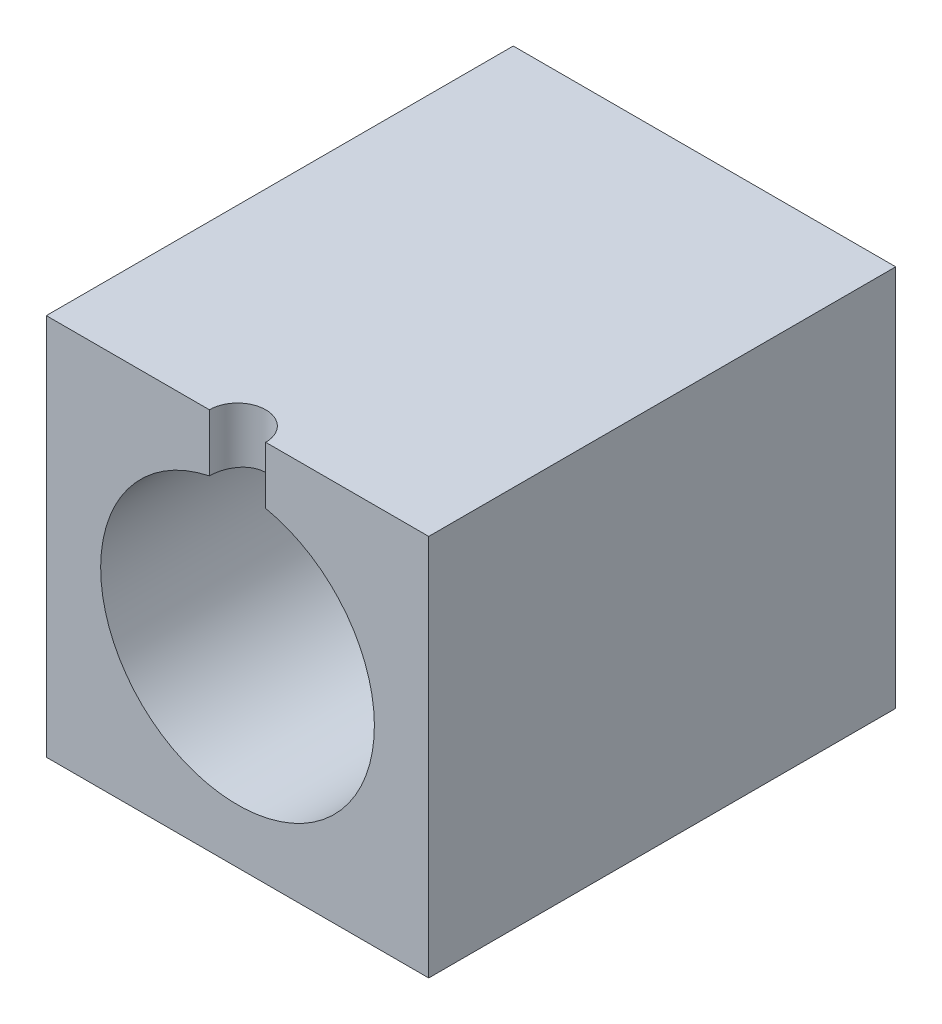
ISO-10303-21;
HEADER;
FILE_DESCRIPTION(('STEP AP214'),'2;1');
FILE_NAME('part.step','',(''),(''),'','','');
FILE_SCHEMA(('AUTOMOTIVE_DESIGN { 1 0 10303 214 1 1 1 1 }'));
ENDSEC;
DATA;
#1=APPLICATION_CONTEXT('core data for automotive mechanical design processes');
#2=APPLICATION_PROTOCOL_DEFINITION('international standard','automotive_design',2000,#1);
#3=PRODUCT_CONTEXT('',#1,'mechanical');
#4=PRODUCT('Part','Part','',(#3));
#5=PRODUCT_RELATED_PRODUCT_CATEGORY('part','',(#4));
#6=PRODUCT_DEFINITION_FORMATION('','',#4);
#7=PRODUCT_DEFINITION_CONTEXT('part definition',#1,'design');
#8=PRODUCT_DEFINITION('design','',#6,#7);
#9=PRODUCT_DEFINITION_SHAPE('','',#8);
#10=(LENGTH_UNIT() NAMED_UNIT(*) SI_UNIT(.MILLI.,.METRE.));
#11=(NAMED_UNIT(*) PLANE_ANGLE_UNIT() SI_UNIT($,.RADIAN.));
#12=(NAMED_UNIT(*) SI_UNIT($,.STERADIAN.) SOLID_ANGLE_UNIT());
#13=UNCERTAINTY_MEASURE_WITH_UNIT(LENGTH_MEASURE(1.E-05),#10,'distance_accuracy_value','');
#14=(GEOMETRIC_REPRESENTATION_CONTEXT(3) GLOBAL_UNCERTAINTY_ASSIGNED_CONTEXT((#13)) GLOBAL_UNIT_ASSIGNED_CONTEXT((#10,
#11,#12)) REPRESENTATION_CONTEXT('',''));
#15=CARTESIAN_POINT('',(0.,0.,0.));
#16=DIRECTION('',(0.,0.,1.));
#17=DIRECTION('',(1.,0.,0.));
#18=AXIS2_PLACEMENT_3D('',#15,#16,#17);
#19=CARTESIAN_POINT('',(0.,0.,58.));
#20=DIRECTION('',(0.,0.,1.));
#21=DIRECTION('',(1.,0.,0.));
#22=AXIS2_PLACEMENT_3D('',#19,#20,#21);
#23=PLANE('',#22);
#24=CARTESIAN_POINT('',(-14.1949152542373,-7.78601694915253,58.));
#25=DIRECTION('',(0.,0.,1.));
#26=DIRECTION('',(1.,0.,0.));
#27=AXIS2_PLACEMENT_3D('',#24,#25,#26);
#28=CIRCLE('',#27,17.);
#29=CARTESIAN_POINT('',(-17.6949152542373,8.8497878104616,58.));
#30=VERTEX_POINT('',#29);
#31=CARTESIAN_POINT('',(-10.6949152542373,8.8497878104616,58.));
#32=VERTEX_POINT('',#31);
#33=EDGE_CURVE('E96',#30,#32,#28,.T.);
#34=ORIENTED_EDGE('',*,*,#33,.F.);
#35=DIRECTION('',(0.,-1.,0.));
#36=VECTOR('',#35,1.);
#37=CARTESIAN_POINT('',(-17.6949152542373,20.9639830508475,58.));
#38=LINE('',#37,#36);
#39=CARTESIAN_POINT('',(-17.6949152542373,15.9639830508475,58.));
#40=VERTEX_POINT('',#39);
#41=EDGE_CURVE('E52',#30,#40,#38,.F.);
#42=ORIENTED_EDGE('',*,*,#41,.T.);
#43=DIRECTION('',(-1.,0.,0.));
#44=VECTOR('',#43,1.);
#45=CARTESIAN_POINT('',(-37.9449152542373,15.9639830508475,58.));
#46=LINE('',#45,#44);
#47=CARTESIAN_POINT('',(-37.9449152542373,15.9639830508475,58.));
#48=VERTEX_POINT('',#47);
#49=EDGE_CURVE('E105',#40,#48,#46,.T.);
#50=ORIENTED_EDGE('',*,*,#49,.T.);
#51=DIRECTION('',(0.,-1.,0.));
#52=VECTOR('',#51,1.);
#53=CARTESIAN_POINT('',(-37.9449152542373,15.9639830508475,58.));
#54=LINE('',#53,#52);
#55=CARTESIAN_POINT('',(-37.9449152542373,-31.5360169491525,58.));
#56=VERTEX_POINT('',#55);
#57=EDGE_CURVE('E114',#48,#56,#54,.T.);
#58=ORIENTED_EDGE('',*,*,#57,.T.);
#59=DIRECTION('',(1.,0.,0.));
#60=VECTOR('',#59,1.);
#61=CARTESIAN_POINT('',(-37.9449152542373,-31.5360169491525,58.));
#62=LINE('',#61,#60);
#63=CARTESIAN_POINT('',(9.55508474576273,-31.5360169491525,58.));
#64=VERTEX_POINT('',#63);
#65=EDGE_CURVE('E117',#56,#64,#62,.T.);
#66=ORIENTED_EDGE('',*,*,#65,.T.);
#67=DIRECTION('',(0.,1.,0.));
#68=VECTOR('',#67,1.);
#69=CARTESIAN_POINT('',(9.55508474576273,15.9639830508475,58.));
#70=LINE('',#69,#68);
#71=CARTESIAN_POINT('',(9.55508474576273,15.9639830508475,58.));
#72=VERTEX_POINT('',#71);
#73=EDGE_CURVE('E102',#64,#72,#70,.T.);
#74=ORIENTED_EDGE('',*,*,#73,.T.);
#75=CARTESIAN_POINT('',(-10.6949152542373,15.9639830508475,58.));
#76=VERTEX_POINT('',#75);
#77=EDGE_CURVE('E99',#72,#76,#46,.T.);
#78=ORIENTED_EDGE('',*,*,#77,.T.);
#79=DIRECTION('',(0.,-1.,0.));
#80=VECTOR('',#79,1.);
#81=CARTESIAN_POINT('',(-10.6949152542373,20.9639830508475,58.));
#82=LINE('',#81,#80);
#83=EDGE_CURVE('E89',#76,#32,#82,.T.);
#84=ORIENTED_EDGE('',*,*,#83,.T.);
#85=EDGE_LOOP('',(#34,#42,#50,#58,#66,#74,#78,#84));
#86=FACE_BOUND('',#85,.T.);
#87=ADVANCED_FACE('F32',(#86),#23,.T.);
#88=CARTESIAN_POINT('',(-14.1949152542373,-7.78601694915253,58.));
#89=DIRECTION('',(0.,0.,-1.));
#90=DIRECTION('',(-1.,0.,0.));
#91=AXIS2_PLACEMENT_3D('',#88,#89,#90);
#92=CYLINDRICAL_SURFACE('',#91,17.);
#93=CARTESIAN_POINT('',(-14.1949152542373,-7.78601694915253,19.));
#94=DIRECTION('',(0.,0.,1.));
#95=DIRECTION('',(1.,0.,0.));
#96=AXIS2_PLACEMENT_3D('',#93,#94,#95);
#97=CIRCLE('',#96,17.);
#98=CARTESIAN_POINT('',(2.80508474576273,-7.78601694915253,19.));
#99=VERTEX_POINT('',#98);
#100=EDGE_CURVE('E103',#99,#99,#97,.T.);
#101=ORIENTED_EDGE('',*,*,#100,.F.);
#102=EDGE_LOOP('',(#101));
#103=FACE_BOUND('',#102,.T.);
#104=ORIENTED_EDGE('',*,*,#33,.T.);
#105=CARTESIAN_POINT('',(-10.6949152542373,8.8497878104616,58.));
#106=CARTESIAN_POINT('',(-10.6949046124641,8.84977910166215,57.9026735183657));
#107=CARTESIAN_POINT('',(-10.6989747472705,8.85064172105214,57.8053529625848));
#108=CARTESIAN_POINT('',(-10.7151940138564,8.85404512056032,57.61142907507));
#109=CARTESIAN_POINT('',(-10.7273421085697,8.8565856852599,57.5148256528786));
#110=CARTESIAN_POINT('',(-10.7596094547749,8.86327526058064,57.3231664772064));
#111=CARTESIAN_POINT('',(-10.7797161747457,8.86742174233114,57.2281085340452));
#112=CARTESIAN_POINT('',(-10.8277217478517,8.87719411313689,57.0400858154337));
#113=CARTESIAN_POINT('',(-10.8556206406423,8.88282000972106,56.9471210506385));
#114=CARTESIAN_POINT('',(-10.9507254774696,8.90168725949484,56.6723256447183));
#115=CARTESIAN_POINT('',(-11.0293660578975,8.91692401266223,56.4944378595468));
#116=CARTESIAN_POINT('',(-11.2147303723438,8.95098755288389,56.1544499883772));
#117=CARTESIAN_POINT('',(-11.3214575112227,8.96981477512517,55.9923518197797));
#118=CARTESIAN_POINT('',(-11.5616798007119,9.00925163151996,55.6860355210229));
#119=CARTESIAN_POINT('',(-11.6955124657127,9.02988166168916,55.5420842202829));
#120=CARTESIAN_POINT('',(-11.9854235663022,9.0704219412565,55.2785033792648));
#121=CARTESIAN_POINT('',(-12.1415054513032,9.09033207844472,55.1588776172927));
#122=CARTESIAN_POINT('',(-12.4732684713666,9.12740983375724,54.9462983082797));
#123=CARTESIAN_POINT('',(-12.6491174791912,9.14455039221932,54.8536016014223));
#124=CARTESIAN_POINT('',(-13.0142972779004,9.17392554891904,54.6991775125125));
#125=CARTESIAN_POINT('',(-13.2036260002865,9.18616089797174,54.6374453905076));
#126=CARTESIAN_POINT('',(-13.5876021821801,9.2042032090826,54.5475360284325));
#127=CARTESIAN_POINT('',(-13.7821388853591,9.2100973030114,54.5189035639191));
#128=CARTESIAN_POINT('',(-14.173342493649,9.2150942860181,54.4945850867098));
#129=CARTESIAN_POINT('',(-14.3700092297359,9.2141977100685,54.49889647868));
#130=CARTESIAN_POINT('',(-14.7567494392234,9.20578134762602,54.5400012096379));
#131=CARTESIAN_POINT('',(-14.9468776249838,9.19836173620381,54.5763032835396));
#132=CARTESIAN_POINT('',(-15.3182830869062,9.1778463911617,54.6795780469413));
#133=CARTESIAN_POINT('',(-15.4995600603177,9.16475046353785,54.7465517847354));
#134=CARTESIAN_POINT('',(-15.84951163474,9.13418983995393,54.9097195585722));
#135=CARTESIAN_POINT('',(-16.0180945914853,9.1166967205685,55.0061046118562));
#136=CARTESIAN_POINT('',(-16.336869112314,9.07926782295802,55.2252110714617));
#137=CARTESIAN_POINT('',(-16.487059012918,9.05933182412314,55.3479348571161));
#138=CARTESIAN_POINT('',(-16.7676922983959,9.01878366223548,55.6189192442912));
#139=CARTESIAN_POINT('',(-16.8977228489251,8.99816580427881,55.7676070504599));
#140=CARTESIAN_POINT('',(-17.1311026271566,8.95891802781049,56.0848954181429));
#141=CARTESIAN_POINT('',(-17.2344444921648,8.94028865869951,56.2535014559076));
#142=CARTESIAN_POINT('',(-17.4117017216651,8.90711062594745,56.6066715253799));
#143=CARTESIAN_POINT('',(-17.4855300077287,8.89257407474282,56.7912808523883));
#144=CARTESIAN_POINT('',(-17.5720595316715,8.87518712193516,57.075477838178));
#145=CARTESIAN_POINT('',(-17.5968651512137,8.87012824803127,57.171407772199));
#146=CARTESIAN_POINT('',(-17.6382656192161,8.86161938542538,57.3650812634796));
#147=CARTESIAN_POINT('',(-17.6548643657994,8.8581686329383,57.4628239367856));
#148=CARTESIAN_POINT('',(-17.6764915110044,8.85365596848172,57.6339148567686));
#149=CARTESIAN_POINT('',(-17.6834034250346,8.85220677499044,57.7070223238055));
#150=CARTESIAN_POINT('',(-17.6926124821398,8.8502723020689,57.8534170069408));
#151=CARTESIAN_POINT('',(-17.6949173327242,8.84978541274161,57.9267037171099));
#152=CARTESIAN_POINT('',(-17.6949152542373,8.8497878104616,58.));
#153=B_SPLINE_CURVE_WITH_KNOTS('',3,(#105,#106,#107,#108,#109,#110,#111,#112,#113,#114,#115,
#116,#117,#118,#119,#120,#121,#122,#123,#124,#125,#126,#127,#128,#129,#130,#131,#132,#133,#134,
#135,#136,#137,#138,#139,#140,#141,#142,#143,#144,#145,#146,#147,#148,#149,#150,#151,#152),
.UNSPECIFIED.,.F.,.F.,(4,2,2,2,2,2,2,2,2,2,2,2,2,2,2,2,2,2,2,2,2,2,2,4),(0.,0.291880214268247,
0.583722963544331,0.875107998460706,1.16649451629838,1.74879841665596,2.33117294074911,
2.92130226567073,3.51152318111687,4.10720132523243,4.70278825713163,5.29008270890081,
5.87733089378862,6.45571514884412,7.03411917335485,7.61636272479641,8.19865889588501,
8.79163820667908,9.38478093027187,9.9796610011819,10.2770041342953,10.5742058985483,
10.7944068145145,11.0142390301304),.UNSPECIFIED.);
#154=EDGE_CURVE('E11',#32,#30,#153,.T.);
#155=ORIENTED_EDGE('',*,*,#154,.T.);
#156=EDGE_LOOP('',(#104,#155));
#157=FACE_BOUND('',#156,.T.);
#158=ADVANCED_FACE('F101',(#103,#157),#92,.F.);
#159=CARTESIAN_POINT('',(0.,0.,0.));
#160=DIRECTION('',(0.,0.,1.));
#161=DIRECTION('',(1.,0.,0.));
#162=AXIS2_PLACEMENT_3D('',#159,#160,#161);
#163=PLANE('',#162);
#164=DIRECTION('',(0.,1.,0.));
#165=VECTOR('',#164,1.);
#166=CARTESIAN_POINT('',(9.55508474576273,15.9639830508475,0.));
#167=LINE('',#166,#165);
#168=CARTESIAN_POINT('',(9.55508474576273,-31.5360169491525,0.));
#169=VERTEX_POINT('',#168);
#170=CARTESIAN_POINT('',(9.55508474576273,15.9639830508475,0.));
#171=VERTEX_POINT('',#170);
#172=EDGE_CURVE('E126',#169,#171,#167,.T.);
#173=ORIENTED_EDGE('',*,*,#172,.F.);
#174=DIRECTION('',(1.,0.,0.));
#175=VECTOR('',#174,1.);
#176=CARTESIAN_POINT('',(-37.9449152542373,-31.5360169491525,0.));
#177=LINE('',#176,#175);
#178=CARTESIAN_POINT('',(-37.9449152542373,-31.5360169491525,0.));
#179=VERTEX_POINT('',#178);
#180=EDGE_CURVE('E59',#179,#169,#177,.T.);
#181=ORIENTED_EDGE('',*,*,#180,.F.);
#182=DIRECTION('',(0.,-1.,0.));
#183=VECTOR('',#182,1.);
#184=CARTESIAN_POINT('',(-37.9449152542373,15.9639830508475,0.));
#185=LINE('',#184,#183);
#186=CARTESIAN_POINT('',(-37.9449152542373,15.9639830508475,0.));
#187=VERTEX_POINT('',#186);
#188=EDGE_CURVE('E131',#187,#179,#185,.T.);
#189=ORIENTED_EDGE('',*,*,#188,.F.);
#190=DIRECTION('',(-1.,0.,0.));
#191=VECTOR('',#190,1.);
#192=CARTESIAN_POINT('',(-37.9449152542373,15.9639830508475,0.));
#193=LINE('',#192,#191);
#194=EDGE_CURVE('E129',#171,#187,#193,.T.);
#195=ORIENTED_EDGE('',*,*,#194,.F.);
#196=EDGE_LOOP('',(#173,#181,#189,#195));
#197=FACE_BOUND('',#196,.T.);
#198=CARTESIAN_POINT('',(-14.1949152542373,-7.78601694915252,0.));
#199=DIRECTION('',(0.,0.,1.));
#200=DIRECTION('',(1.,0.,0.));
#201=AXIS2_PLACEMENT_3D('',#198,#199,#200);
#202=CIRCLE('',#201,18.6728986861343);
#203=CARTESIAN_POINT('',(4.47798343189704,-7.78601694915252,0.));
#204=VERTEX_POINT('',#203);
#205=EDGE_CURVE('E123',#204,#204,#202,.T.);
#206=ORIENTED_EDGE('',*,*,#205,.T.);
#207=EDGE_LOOP('',(#206));
#208=FACE_BOUND('',#207,.T.);
#209=ADVANCED_FACE('F148',(#197,#208),#163,.F.);
#210=CARTESIAN_POINT('',(9.55508474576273,15.9639830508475,19.));
#211=DIRECTION('',(-1.,0.,0.));
#212=DIRECTION('',(0.,0.,1.));
#213=AXIS2_PLACEMENT_3D('',#210,#211,#212);
#214=PLANE('',#213);
#215=ORIENTED_EDGE('',*,*,#172,.T.);
#216=DIRECTION('',(0.,0.,-1.));
#217=VECTOR('',#216,1.);
#218=CARTESIAN_POINT('',(9.55508474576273,15.9639830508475,19.));
#219=LINE('',#218,#217);
#220=EDGE_CURVE('E45',#72,#171,#219,.T.);
#221=ORIENTED_EDGE('',*,*,#220,.F.);
#222=ORIENTED_EDGE('',*,*,#73,.F.);
#223=DIRECTION('',(0.,0.,-1.));
#224=VECTOR('',#223,1.);
#225=CARTESIAN_POINT('',(9.55508474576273,-31.5360169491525,19.));
#226=LINE('',#225,#224);
#227=EDGE_CURVE('E134',#64,#169,#226,.T.);
#228=ORIENTED_EDGE('',*,*,#227,.T.);
#229=EDGE_LOOP('',(#215,#221,#222,#228));
#230=FACE_BOUND('',#229,.T.);
#231=ADVANCED_FACE('F34',(#230),#214,.F.);
#232=CARTESIAN_POINT('',(-37.9449152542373,15.9639830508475,19.));
#233=DIRECTION('',(0.,-1.,0.));
#234=DIRECTION('',(1.,0.,0.));
#235=AXIS2_PLACEMENT_3D('',#232,#233,#234);
#236=PLANE('',#235);
#237=CARTESIAN_POINT('',(-14.1949152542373,15.9639830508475,58.));
#238=DIRECTION('',(0.,-1.,0.));
#239=DIRECTION('',(1.,0.,0.));
#240=AXIS2_PLACEMENT_3D('',#237,#238,#239);
#241=CIRCLE('',#240,3.5);
#242=EDGE_CURVE('E108',#76,#40,#241,.F.);
#243=ORIENTED_EDGE('',*,*,#242,.F.);
#244=ORIENTED_EDGE('',*,*,#77,.F.);
#245=ORIENTED_EDGE('',*,*,#220,.T.);
#246=ORIENTED_EDGE('',*,*,#194,.T.);
#247=DIRECTION('',(0.,0.,-1.));
#248=VECTOR('',#247,1.);
#249=CARTESIAN_POINT('',(-37.9449152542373,15.9639830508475,19.));
#250=LINE('',#249,#248);
#251=EDGE_CURVE('E138',#48,#187,#250,.T.);
#252=ORIENTED_EDGE('',*,*,#251,.F.);
#253=ORIENTED_EDGE('',*,*,#49,.F.);
#254=EDGE_LOOP('',(#243,#244,#245,#246,#252,#253));
#255=FACE_BOUND('',#254,.T.);
#256=ADVANCED_FACE('F142',(#255),#236,.F.);
#257=CARTESIAN_POINT('',(-37.9449152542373,15.9639830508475,19.));
#258=DIRECTION('',(1.,0.,0.));
#259=DIRECTION('',(0.,0.,-1.));
#260=AXIS2_PLACEMENT_3D('',#257,#258,#259);
#261=PLANE('',#260);
#262=ORIENTED_EDGE('',*,*,#188,.T.);
#263=DIRECTION('',(0.,0.,-1.));
#264=VECTOR('',#263,1.);
#265=CARTESIAN_POINT('',(-37.9449152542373,-31.5360169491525,19.));
#266=LINE('',#265,#264);
#267=EDGE_CURVE('E136',#56,#179,#266,.T.);
#268=ORIENTED_EDGE('',*,*,#267,.F.);
#269=ORIENTED_EDGE('',*,*,#57,.F.);
#270=ORIENTED_EDGE('',*,*,#251,.T.);
#271=EDGE_LOOP('',(#262,#268,#269,#270));
#272=FACE_BOUND('',#271,.T.);
#273=ADVANCED_FACE('F152',(#272),#261,.F.);
#274=CARTESIAN_POINT('',(-37.9449152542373,-31.5360169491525,19.));
#275=DIRECTION('',(0.,1.,0.));
#276=DIRECTION('',(0.,0.,1.));
#277=AXIS2_PLACEMENT_3D('',#274,#275,#276);
#278=PLANE('',#277);
#279=ORIENTED_EDGE('',*,*,#180,.T.);
#280=ORIENTED_EDGE('',*,*,#227,.F.);
#281=ORIENTED_EDGE('',*,*,#65,.F.);
#282=ORIENTED_EDGE('',*,*,#267,.T.);
#283=EDGE_LOOP('',(#279,#280,#281,#282));
#284=FACE_BOUND('',#283,.T.);
#285=ADVANCED_FACE('F155',(#284),#278,.F.);
#286=CARTESIAN_POINT('',(-14.1949152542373,-7.78601694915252,19.));
#287=DIRECTION('',(0.,0.,-1.));
#288=DIRECTION('',(-1.,0.,0.));
#289=AXIS2_PLACEMENT_3D('',#286,#287,#288);
#290=CYLINDRICAL_SURFACE('',#289,18.6728986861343);
#291=CARTESIAN_POINT('',(-14.1949152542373,-7.78601694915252,19.));
#292=DIRECTION('',(0.,0.,1.));
#293=DIRECTION('',(1.,0.,0.));
#294=AXIS2_PLACEMENT_3D('',#291,#292,#293);
#295=CIRCLE('',#294,18.6728986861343);
#296=CARTESIAN_POINT('',(4.47798343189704,-7.78601694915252,19.));
#297=VERTEX_POINT('',#296);
#298=EDGE_CURVE('E120',#297,#297,#295,.T.);
#299=ORIENTED_EDGE('',*,*,#298,.T.);
#300=EDGE_LOOP('',(#299));
#301=FACE_BOUND('',#300,.T.);
#302=ORIENTED_EDGE('',*,*,#205,.F.);
#303=EDGE_LOOP('',(#302));
#304=FACE_BOUND('',#303,.T.);
#305=ADVANCED_FACE('F158',(#301,#304),#290,.F.);
#306=CARTESIAN_POINT('',(0.,0.,19.));
#307=DIRECTION('',(0.,0.,1.));
#308=DIRECTION('',(1.,0.,0.));
#309=AXIS2_PLACEMENT_3D('',#306,#307,#308);
#310=PLANE('',#309);
#311=ORIENTED_EDGE('',*,*,#100,.T.);
#312=EDGE_LOOP('',(#311));
#313=FACE_BOUND('',#312,.T.);
#314=ORIENTED_EDGE('',*,*,#298,.F.);
#315=EDGE_LOOP('',(#314));
#316=FACE_BOUND('',#315,.T.);
#317=ADVANCED_FACE('F164',(#313,#316),#310,.F.);
#318=CARTESIAN_POINT('',(-14.1949152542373,20.9639830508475,58.));
#319=DIRECTION('',(0.,-1.,0.));
#320=DIRECTION('',(1.,0.,0.));
#321=AXIS2_PLACEMENT_3D('',#318,#319,#320);
#322=CYLINDRICAL_SURFACE('',#321,3.5);
#323=ORIENTED_EDGE('',*,*,#242,.T.);
#324=ORIENTED_EDGE('',*,*,#41,.F.);
#325=ORIENTED_EDGE('',*,*,#154,.F.);
#326=ORIENTED_EDGE('',*,*,#83,.F.);
#327=EDGE_LOOP('',(#323,#324,#325,#326));
#328=FACE_BOUND('',#327,.T.);
#329=ADVANCED_FACE('F88',(#328),#322,.F.);
#330=CLOSED_SHELL('',(#87,#158,#209,#231,#256,#273,#285,#305,#317,#329));
#331=MANIFOLD_SOLID_BREP('B2',#330);
#332=ADVANCED_BREP_SHAPE_REPRESENTATION('',(#18,#331),#14);
#333=SHAPE_DEFINITION_REPRESENTATION(#9,#332);
ENDSEC;
END-ISO-10303-21;
